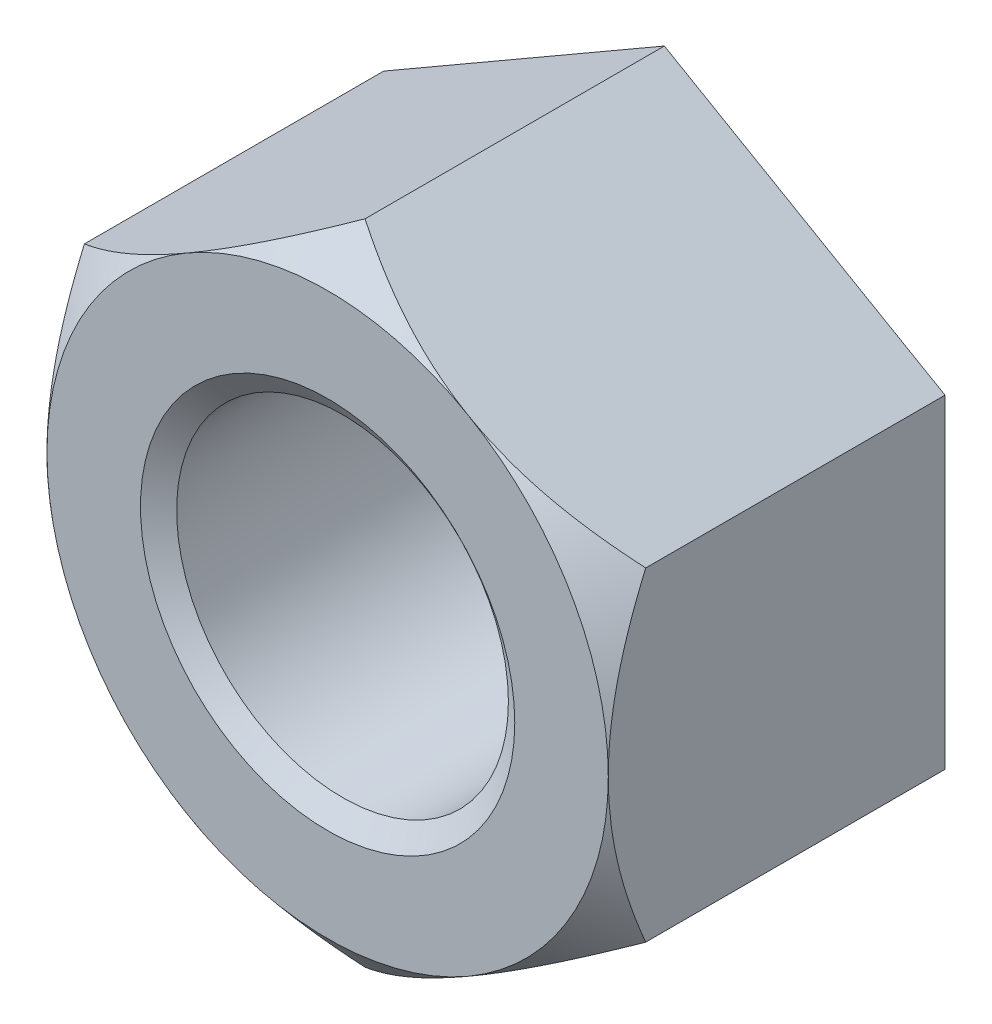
from build123d import *

# Parameters (mm, degrees)
BASENUT_START = -31.4198
BASENUTSKE_R  = 15.47876
BASENUT_DEPTH = 31.4198


with BuildPart() as part:
    # BaseNutSke → BaseNut (new body)
    with BuildSketch(Plane.XY.offset(BASENUT_START)):
        Polygon((26.1874, 15.119302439), (26.1874, -15.119302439), (0, -30.238604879), (-26.1874, -15.119302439), (-26.1874, 15.119302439), (0, 30.238604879), align=None)
        Circle(BASENUTSKE_R, mode=Mode.SUBTRACT)
    extrude(amount=BASENUT_DEPTH)

    # Sketch2 → Single-Chamfer (revolve, cut)
    with BuildSketch(Plane(origin=(0, 0, 0), x_dir=(0, 0, -1), z_dir=(1, 0, 0))):
        Polygon((0, 26.1874), (-12.7, 26.1874), (-12.7, 42.938604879), (3.4925, 42.938604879), (3.4925, 30.238604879), align=None)
    revolve(axis=Axis((0, 0, 0), (0, 0, -1)), mode=Mode.SUBTRACT)

    # EndChamferSketch → EndChamfer (revolve, cut)
    with BuildSketch(Plane(origin=(0, 0, 0), x_dir=(0, 0, -1), z_dir=(1, 0, 0)), mode=Mode.PRIVATE) as endchamfer_sk:
        Polygon((31.3944, 17.4625), (29.866467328, 15.280386), (31.4452, 15.280386), (31.4452, 17.4625), align=None)
        Polygon((-0.0508, 17.4625), (0, 17.4625), (1.527932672, 15.280386), (-0.0508, 15.280386), align=None)
    revolve(endchamfer_sk.sketch.rotate(Axis((0, 0, -25.037505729), (0, 0, -1)), 90), axis=Axis((0, 0, -25.037505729), (0, 0, -1)), mode=Mode.SUBTRACT)


solid = part.part
